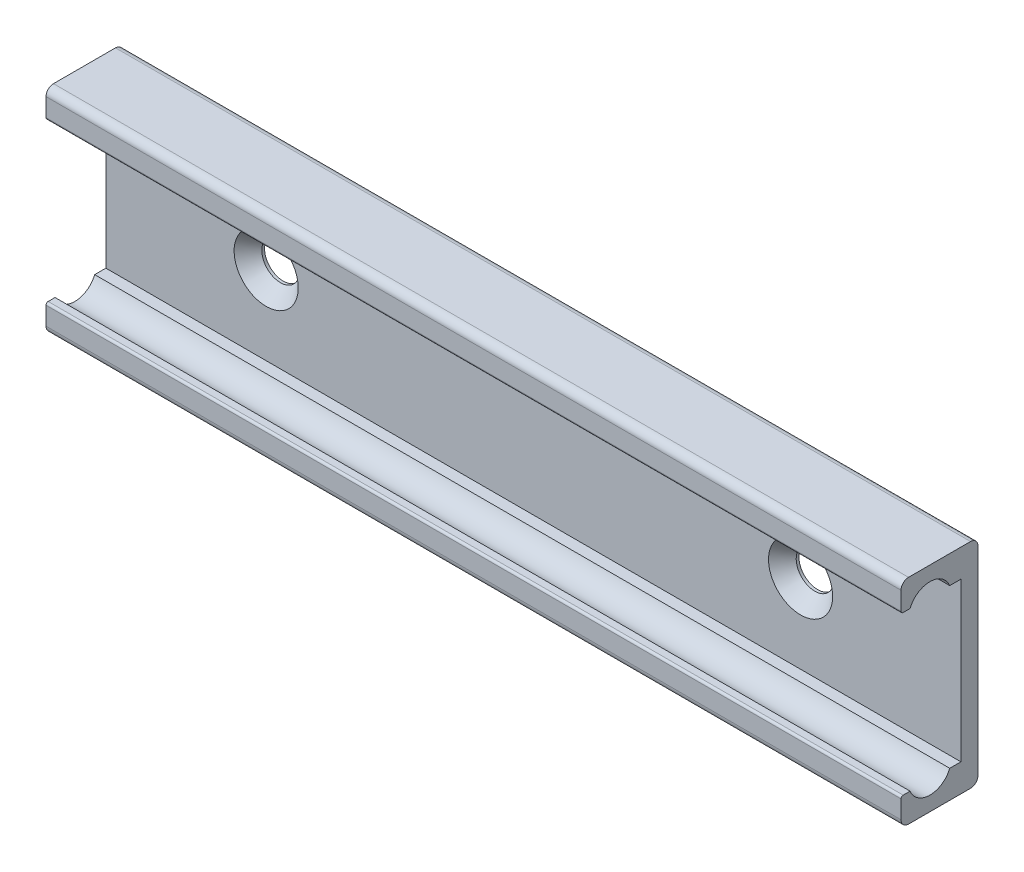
ISO-10303-21;
HEADER;
FILE_DESCRIPTION(('STEP AP214'),'2;1');
FILE_NAME('part.step','',(''),(''),'','','');
FILE_SCHEMA(('AUTOMOTIVE_DESIGN { 1 0 10303 214 1 1 1 1 }'));
ENDSEC;
DATA;
#1=APPLICATION_CONTEXT('core data for automotive mechanical design processes');
#2=APPLICATION_PROTOCOL_DEFINITION('international standard','automotive_design',2000,#1);
#3=PRODUCT_CONTEXT('',#1,'mechanical');
#4=PRODUCT('Part','Part','',(#3));
#5=PRODUCT_RELATED_PRODUCT_CATEGORY('part','',(#4));
#6=PRODUCT_DEFINITION_FORMATION('','',#4);
#7=PRODUCT_DEFINITION_CONTEXT('part definition',#1,'design');
#8=PRODUCT_DEFINITION('design','',#6,#7);
#9=PRODUCT_DEFINITION_SHAPE('','',#8);
#10=(LENGTH_UNIT() NAMED_UNIT(*) SI_UNIT(.MILLI.,.METRE.));
#11=(NAMED_UNIT(*) PLANE_ANGLE_UNIT() SI_UNIT($,.RADIAN.));
#12=(NAMED_UNIT(*) SI_UNIT($,.STERADIAN.) SOLID_ANGLE_UNIT());
#13=UNCERTAINTY_MEASURE_WITH_UNIT(LENGTH_MEASURE(1.E-05),#10,'distance_accuracy_value','');
#14=(GEOMETRIC_REPRESENTATION_CONTEXT(3) GLOBAL_UNCERTAINTY_ASSIGNED_CONTEXT((#13)) GLOBAL_UNIT_ASSIGNED_CONTEXT((#10,
#11,#12)) REPRESENTATION_CONTEXT('',''));
#15=CARTESIAN_POINT('',(0.,0.,0.));
#16=DIRECTION('',(0.,0.,1.));
#17=DIRECTION('',(1.,0.,0.));
#18=AXIS2_PLACEMENT_3D('',#15,#16,#17);
#19=CARTESIAN_POINT('',(65.,9.3,6.49999999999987));
#20=DIRECTION('',(-1.,0.,0.));
#21=DIRECTION('',(0.,0.,1.));
#22=AXIS2_PLACEMENT_3D('',#19,#20,#21);
#23=CYLINDRICAL_SURFACE('',#22,0.7);
#24=CARTESIAN_POINT('',(-15.,9.3,6.49999999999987));
#25=DIRECTION('',(-1.,0.,0.));
#26=DIRECTION('',(0.,0.,-1.));
#27=AXIS2_PLACEMENT_3D('',#24,#25,#26);
#28=CIRCLE('',#27,0.7);
#29=CARTESIAN_POINT('',(-15.,9.3,7.19999999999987));
#30=VERTEX_POINT('',#29);
#31=CARTESIAN_POINT('',(-15.,10.,6.49999999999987));
#32=VERTEX_POINT('',#31);
#33=EDGE_CURVE('E139',#30,#32,#28,.T.);
#34=ORIENTED_EDGE('',*,*,#33,.F.);
#35=DIRECTION('',(-1.,0.,0.));
#36=VECTOR('',#35,1.);
#37=CARTESIAN_POINT('',(65.,9.3,7.19999999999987));
#38=LINE('',#37,#36);
#39=CARTESIAN_POINT('',(65.,9.3,7.19999999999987));
#40=VERTEX_POINT('',#39);
#41=EDGE_CURVE('E9',#40,#30,#38,.T.);
#42=ORIENTED_EDGE('',*,*,#41,.F.);
#43=CARTESIAN_POINT('',(65.,9.3,6.49999999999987));
#44=DIRECTION('',(-1.,0.,0.));
#45=DIRECTION('',(0.,0.,-1.));
#46=AXIS2_PLACEMENT_3D('',#43,#44,#45);
#47=CIRCLE('',#46,0.7);
#48=CARTESIAN_POINT('',(65.,10.,6.49999999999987));
#49=VERTEX_POINT('',#48);
#50=EDGE_CURVE('E141',#40,#49,#47,.T.);
#51=ORIENTED_EDGE('',*,*,#50,.T.);
#52=DIRECTION('',(-1.,0.,0.));
#53=VECTOR('',#52,1.);
#54=CARTESIAN_POINT('',(65.,10.,6.49999999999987));
#55=LINE('',#54,#53);
#56=EDGE_CURVE('E136',#49,#32,#55,.T.);
#57=ORIENTED_EDGE('',*,*,#56,.T.);
#58=EDGE_LOOP('',(#34,#42,#51,#57));
#59=FACE_BOUND('',#58,.T.);
#60=ADVANCED_FACE('F14',(#59),#23,.T.);
#61=CARTESIAN_POINT('',(65.,7.60000008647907,7.19999999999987));
#62=DIRECTION('',(0.,0.,1.));
#63=DIRECTION('',(1.,0.,0.));
#64=AXIS2_PLACEMENT_3D('',#61,#62,#63);
#65=PLANE('',#64);
#66=DIRECTION('',(0.,1.,0.));
#67=VECTOR('',#66,1.);
#68=CARTESIAN_POINT('',(-15.,7.60000008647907,7.19999999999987));
#69=LINE('',#68,#67);
#70=CARTESIAN_POINT('',(-15.,7.60000008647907,7.19999999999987));
#71=VERTEX_POINT('',#70);
#72=EDGE_CURVE('E158',#71,#30,#69,.T.);
#73=ORIENTED_EDGE('',*,*,#72,.F.);
#74=DIRECTION('',(-1.,0.,0.));
#75=VECTOR('',#74,1.);
#76=CARTESIAN_POINT('',(65.,7.60000008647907,7.19999999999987));
#77=LINE('',#76,#75);
#78=CARTESIAN_POINT('',(65.,7.60000008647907,7.19999999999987));
#79=VERTEX_POINT('',#78);
#80=EDGE_CURVE('E22',#79,#71,#77,.T.);
#81=ORIENTED_EDGE('',*,*,#80,.F.);
#82=DIRECTION('',(0.,1.,0.));
#83=VECTOR('',#82,1.);
#84=CARTESIAN_POINT('',(65.,7.60000008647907,7.19999999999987));
#85=LINE('',#84,#83);
#86=EDGE_CURVE('E146',#79,#40,#85,.T.);
#87=ORIENTED_EDGE('',*,*,#86,.T.);
#88=ORIENTED_EDGE('',*,*,#41,.T.);
#89=EDGE_LOOP('',(#73,#81,#87,#88));
#90=FACE_BOUND('',#89,.T.);
#91=ADVANCED_FACE('F319',(#90),#65,.T.);
#92=CARTESIAN_POINT('',(65.,7.60000008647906,6.99999999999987));
#93=DIRECTION('',(-1.,0.,0.));
#94=DIRECTION('',(0.,0.,1.));
#95=AXIS2_PLACEMENT_3D('',#92,#93,#94);
#96=CYLINDRICAL_SURFACE('',#95,0.2);
#97=CARTESIAN_POINT('',(-15.,7.60000008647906,6.99999999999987));
#98=DIRECTION('',(-1.,0.,0.));
#99=DIRECTION('',(0.,0.,-1.));
#100=AXIS2_PLACEMENT_3D('',#97,#98,#99);
#101=CIRCLE('',#100,0.2);
#102=CARTESIAN_POINT('',(-15.,7.40000008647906,6.99999999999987));
#103=VERTEX_POINT('',#102);
#104=EDGE_CURVE('E206',#103,#71,#101,.T.);
#105=ORIENTED_EDGE('',*,*,#104,.F.);
#106=DIRECTION('',(-1.,0.,0.));
#107=VECTOR('',#106,1.);
#108=CARTESIAN_POINT('',(65.,7.40000008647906,6.99999999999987));
#109=LINE('',#108,#107);
#110=CARTESIAN_POINT('',(65.,7.40000008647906,6.99999999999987));
#111=VERTEX_POINT('',#110);
#112=EDGE_CURVE('E258',#111,#103,#109,.T.);
#113=ORIENTED_EDGE('',*,*,#112,.F.);
#114=CARTESIAN_POINT('',(65.,7.60000008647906,6.99999999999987));
#115=DIRECTION('',(-1.,0.,0.));
#116=DIRECTION('',(0.,0.,-1.));
#117=AXIS2_PLACEMENT_3D('',#114,#115,#116);
#118=CIRCLE('',#117,0.2);
#119=EDGE_CURVE('E254',#111,#79,#118,.T.);
#120=ORIENTED_EDGE('',*,*,#119,.T.);
#121=ORIENTED_EDGE('',*,*,#80,.T.);
#122=EDGE_LOOP('',(#105,#113,#120,#121));
#123=FACE_BOUND('',#122,.T.);
#124=ADVANCED_FACE('F324',(#123),#96,.T.);
#125=CARTESIAN_POINT('',(65.,7.40000008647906,6.35404949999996));
#126=DIRECTION('',(0.,-1.,0.));
#127=DIRECTION('',(1.,0.,0.));
#128=AXIS2_PLACEMENT_3D('',#125,#126,#127);
#129=PLANE('',#128);
#130=DIRECTION('',(0.,0.,1.));
#131=VECTOR('',#130,1.);
#132=CARTESIAN_POINT('',(-15.,7.40000008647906,6.35404949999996));
#133=LINE('',#132,#131);
#134=CARTESIAN_POINT('',(-15.,7.40000008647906,6.35404949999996));
#135=VERTEX_POINT('',#134);
#136=EDGE_CURVE('E203',#135,#103,#133,.T.);
#137=ORIENTED_EDGE('',*,*,#136,.F.);
#138=DIRECTION('',(-1.,0.,0.));
#139=VECTOR('',#138,1.);
#140=CARTESIAN_POINT('',(65.,7.40000008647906,6.35404949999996));
#141=LINE('',#140,#139);
#142=CARTESIAN_POINT('',(65.,7.40000008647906,6.35404949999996));
#143=VERTEX_POINT('',#142);
#144=EDGE_CURVE('E260',#143,#135,#141,.T.);
#145=ORIENTED_EDGE('',*,*,#144,.F.);
#146=DIRECTION('',(0.,0.,1.));
#147=VECTOR('',#146,1.);
#148=CARTESIAN_POINT('',(65.,7.40000008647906,6.35404949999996));
#149=LINE('',#148,#147);
#150=EDGE_CURVE('E251',#143,#111,#149,.T.);
#151=ORIENTED_EDGE('',*,*,#150,.T.);
#152=ORIENTED_EDGE('',*,*,#112,.T.);
#153=EDGE_LOOP('',(#137,#145,#151,#152));
#154=FACE_BOUND('',#153,.T.);
#155=ADVANCED_FACE('F330',(#154),#129,.T.);
#156=CARTESIAN_POINT('',(65.,6.65000008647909,4.50000000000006));
#157=DIRECTION('',(-1.,0.,0.));
#158=DIRECTION('',(0.,0.,1.));
#159=AXIS2_PLACEMENT_3D('',#156,#157,#158);
#160=CYLINDRICAL_SURFACE('',#159,1.99999988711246);
#161=CARTESIAN_POINT('',(-15.,6.65000008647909,4.50000000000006));
#162=DIRECTION('',(1.,0.,0.));
#163=DIRECTION('',(0.,0.,1.));
#164=AXIS2_PLACEMENT_3D('',#161,#162,#163);
#165=CIRCLE('',#164,1.99999988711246);
#166=CARTESIAN_POINT('',(-15.,7.40000008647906,2.64595050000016));
#167=VERTEX_POINT('',#166);
#168=EDGE_CURVE('E200',#167,#135,#165,.T.);
#169=ORIENTED_EDGE('',*,*,#168,.F.);
#170=DIRECTION('',(-1.,0.,0.));
#171=VECTOR('',#170,1.);
#172=CARTESIAN_POINT('',(65.,7.40000008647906,2.64595050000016));
#173=LINE('',#172,#171);
#174=CARTESIAN_POINT('',(65.,7.40000008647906,2.64595050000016));
#175=VERTEX_POINT('',#174);
#176=EDGE_CURVE('E262',#175,#167,#173,.T.);
#177=ORIENTED_EDGE('',*,*,#176,.F.);
#178=CARTESIAN_POINT('',(65.,6.65000008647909,4.50000000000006));
#179=DIRECTION('',(1.,0.,0.));
#180=DIRECTION('',(0.,0.,1.));
#181=AXIS2_PLACEMENT_3D('',#178,#179,#180);
#182=CIRCLE('',#181,1.99999988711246);
#183=EDGE_CURVE('E248',#175,#143,#182,.T.);
#184=ORIENTED_EDGE('',*,*,#183,.T.);
#185=ORIENTED_EDGE('',*,*,#144,.T.);
#186=EDGE_LOOP('',(#169,#177,#184,#185));
#187=FACE_BOUND('',#186,.T.);
#188=ADVANCED_FACE('F339',(#187),#160,.F.);
#189=CARTESIAN_POINT('',(65.,7.40000008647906,1.60000000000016));
#190=DIRECTION('',(0.,-1.,0.));
#191=DIRECTION('',(1.,0.,0.));
#192=AXIS2_PLACEMENT_3D('',#189,#190,#191);
#193=PLANE('',#192);
#194=DIRECTION('',(0.,0.,1.));
#195=VECTOR('',#194,1.);
#196=CARTESIAN_POINT('',(-15.,7.40000008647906,1.60000000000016));
#197=LINE('',#196,#195);
#198=CARTESIAN_POINT('',(-15.,7.40000008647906,1.60000000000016));
#199=VERTEX_POINT('',#198);
#200=EDGE_CURVE('E197',#199,#167,#197,.T.);
#201=ORIENTED_EDGE('',*,*,#200,.F.);
#202=DIRECTION('',(-1.,0.,0.));
#203=VECTOR('',#202,1.);
#204=CARTESIAN_POINT('',(65.,7.40000008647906,1.60000000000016));
#205=LINE('',#204,#203);
#206=CARTESIAN_POINT('',(65.,7.40000008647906,1.60000000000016));
#207=VERTEX_POINT('',#206);
#208=EDGE_CURVE('E264',#207,#199,#205,.T.);
#209=ORIENTED_EDGE('',*,*,#208,.F.);
#210=DIRECTION('',(0.,0.,1.));
#211=VECTOR('',#210,1.);
#212=CARTESIAN_POINT('',(65.,7.40000008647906,1.60000000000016));
#213=LINE('',#212,#211);
#214=EDGE_CURVE('E245',#207,#175,#213,.T.);
#215=ORIENTED_EDGE('',*,*,#214,.T.);
#216=ORIENTED_EDGE('',*,*,#176,.T.);
#217=EDGE_LOOP('',(#201,#209,#215,#216));
#218=FACE_BOUND('',#217,.T.);
#219=ADVANCED_FACE('F343',(#218),#193,.T.);
#220=CARTESIAN_POINT('',(65.,-7.40000008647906,1.60000000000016));
#221=DIRECTION('',(0.,0.,1.));
#222=DIRECTION('',(0.,1.,0.));
#223=AXIS2_PLACEMENT_3D('',#220,#221,#222);
#224=PLANE('',#223);
#225=CARTESIAN_POINT('',(50.,0.,1.60000000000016));
#226=DIRECTION('',(0.,0.,1.));
#227=DIRECTION('',(0.,1.,0.));
#228=AXIS2_PLACEMENT_3D('',#225,#226,#227);
#229=CIRCLE('',#228,3.);
#230=CARTESIAN_POINT('',(50.,3.,1.60000000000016));
#231=VERTEX_POINT('',#230);
#232=EDGE_CURVE('E291',#231,#231,#229,.T.);
#233=ORIENTED_EDGE('',*,*,#232,.F.);
#234=EDGE_LOOP('',(#233));
#235=FACE_BOUND('',#234,.T.);
#236=CARTESIAN_POINT('',(0.,0.,1.60000000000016));
#237=DIRECTION('',(0.,0.,1.));
#238=DIRECTION('',(0.,1.,0.));
#239=AXIS2_PLACEMENT_3D('',#236,#237,#238);
#240=CIRCLE('',#239,3.);
#241=CARTESIAN_POINT('',(0.,3.,1.60000000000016));
#242=VERTEX_POINT('',#241);
#243=EDGE_CURVE('E159',#242,#242,#240,.T.);
#244=ORIENTED_EDGE('',*,*,#243,.F.);
#245=EDGE_LOOP('',(#244));
#246=FACE_BOUND('',#245,.T.);
#247=DIRECTION('',(0.,1.,0.));
#248=VECTOR('',#247,1.);
#249=CARTESIAN_POINT('',(-15.,-7.40000008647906,1.60000000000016));
#250=LINE('',#249,#248);
#251=CARTESIAN_POINT('',(-15.,-7.40000008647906,1.60000000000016));
#252=VERTEX_POINT('',#251);
#253=EDGE_CURVE('E194',#252,#199,#250,.T.);
#254=ORIENTED_EDGE('',*,*,#253,.F.);
#255=DIRECTION('',(-1.,0.,0.));
#256=VECTOR('',#255,1.);
#257=CARTESIAN_POINT('',(65.,-7.40000008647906,1.60000000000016));
#258=LINE('',#257,#256);
#259=CARTESIAN_POINT('',(65.,-7.40000008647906,1.60000000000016));
#260=VERTEX_POINT('',#259);
#261=EDGE_CURVE('E266',#260,#252,#258,.T.);
#262=ORIENTED_EDGE('',*,*,#261,.F.);
#263=DIRECTION('',(0.,1.,0.));
#264=VECTOR('',#263,1.);
#265=CARTESIAN_POINT('',(65.,-7.40000008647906,1.60000000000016));
#266=LINE('',#265,#264);
#267=EDGE_CURVE('E242',#260,#207,#266,.T.);
#268=ORIENTED_EDGE('',*,*,#267,.T.);
#269=ORIENTED_EDGE('',*,*,#208,.T.);
#270=EDGE_LOOP('',(#254,#262,#268,#269));
#271=FACE_BOUND('',#270,.T.);
#272=ADVANCED_FACE('F347',(#235,#246,#271),#224,.T.);
#273=CARTESIAN_POINT('',(65.,-7.40000008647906,1.60000000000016));
#274=DIRECTION('',(0.,1.,0.));
#275=DIRECTION('',(-1.,0.,0.));
#276=AXIS2_PLACEMENT_3D('',#273,#274,#275);
#277=PLANE('',#276);
#278=DIRECTION('',(0.,0.,-1.));
#279=VECTOR('',#278,1.);
#280=CARTESIAN_POINT('',(-15.,-7.40000008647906,1.60000000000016));
#281=LINE('',#280,#279);
#282=CARTESIAN_POINT('',(-15.,-7.40000008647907,2.64595050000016));
#283=VERTEX_POINT('',#282);
#284=EDGE_CURVE('E191',#283,#252,#281,.T.);
#285=ORIENTED_EDGE('',*,*,#284,.F.);
#286=DIRECTION('',(-1.,0.,0.));
#287=VECTOR('',#286,1.);
#288=CARTESIAN_POINT('',(65.,-7.40000008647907,2.64595050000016));
#289=LINE('',#288,#287);
#290=CARTESIAN_POINT('',(65.,-7.40000008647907,2.64595050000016));
#291=VERTEX_POINT('',#290);
#292=EDGE_CURVE('E268',#291,#283,#289,.T.);
#293=ORIENTED_EDGE('',*,*,#292,.F.);
#294=DIRECTION('',(0.,0.,-1.));
#295=VECTOR('',#294,1.);
#296=CARTESIAN_POINT('',(65.,-7.40000008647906,1.60000000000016));
#297=LINE('',#296,#295);
#298=EDGE_CURVE('E239',#291,#260,#297,.T.);
#299=ORIENTED_EDGE('',*,*,#298,.T.);
#300=ORIENTED_EDGE('',*,*,#261,.T.);
#301=EDGE_LOOP('',(#285,#293,#299,#300));
#302=FACE_BOUND('',#301,.T.);
#303=ADVANCED_FACE('F351',(#302),#277,.T.);
#304=CARTESIAN_POINT('',(65.,-6.65000008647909,4.50000000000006));
#305=DIRECTION('',(-1.,0.,0.));
#306=DIRECTION('',(0.,0.,1.));
#307=AXIS2_PLACEMENT_3D('',#304,#305,#306);
#308=CYLINDRICAL_SURFACE('',#307,1.99999988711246);
#309=CARTESIAN_POINT('',(-15.,-6.65000008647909,4.50000000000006));
#310=DIRECTION('',(1.,0.,0.));
#311=DIRECTION('',(0.,0.,-1.));
#312=AXIS2_PLACEMENT_3D('',#309,#310,#311);
#313=CIRCLE('',#312,1.99999988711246);
#314=CARTESIAN_POINT('',(-15.,-7.40000008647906,6.35404949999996));
#315=VERTEX_POINT('',#314);
#316=EDGE_CURVE('E188',#315,#283,#313,.T.);
#317=ORIENTED_EDGE('',*,*,#316,.F.);
#318=DIRECTION('',(-1.,0.,0.));
#319=VECTOR('',#318,1.);
#320=CARTESIAN_POINT('',(65.,-7.40000008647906,6.35404949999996));
#321=LINE('',#320,#319);
#322=CARTESIAN_POINT('',(65.,-7.40000008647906,6.35404949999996));
#323=VERTEX_POINT('',#322);
#324=EDGE_CURVE('E270',#323,#315,#321,.T.);
#325=ORIENTED_EDGE('',*,*,#324,.F.);
#326=CARTESIAN_POINT('',(65.,-6.65000008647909,4.50000000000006));
#327=DIRECTION('',(1.,0.,0.));
#328=DIRECTION('',(0.,0.,-1.));
#329=AXIS2_PLACEMENT_3D('',#326,#327,#328);
#330=CIRCLE('',#329,1.99999988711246);
#331=EDGE_CURVE('E236',#323,#291,#330,.T.);
#332=ORIENTED_EDGE('',*,*,#331,.T.);
#333=ORIENTED_EDGE('',*,*,#292,.T.);
#334=EDGE_LOOP('',(#317,#325,#332,#333));
#335=FACE_BOUND('',#334,.T.);
#336=ADVANCED_FACE('F355',(#335),#308,.F.);
#337=CARTESIAN_POINT('',(65.,-7.40000008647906,6.35404949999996));
#338=DIRECTION('',(0.,1.,0.));
#339=DIRECTION('',(-1.,0.,0.));
#340=AXIS2_PLACEMENT_3D('',#337,#338,#339);
#341=PLANE('',#340);
#342=DIRECTION('',(0.,0.,-1.));
#343=VECTOR('',#342,1.);
#344=CARTESIAN_POINT('',(-15.,-7.40000008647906,6.35404949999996));
#345=LINE('',#344,#343);
#346=CARTESIAN_POINT('',(-15.,-7.40000008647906,6.99999999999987));
#347=VERTEX_POINT('',#346);
#348=EDGE_CURVE('E185',#347,#315,#345,.T.);
#349=ORIENTED_EDGE('',*,*,#348,.F.);
#350=DIRECTION('',(-1.,0.,0.));
#351=VECTOR('',#350,1.);
#352=CARTESIAN_POINT('',(65.,-7.40000008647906,6.99999999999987));
#353=LINE('',#352,#351);
#354=CARTESIAN_POINT('',(65.,-7.40000008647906,6.99999999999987));
#355=VERTEX_POINT('',#354);
#356=EDGE_CURVE('E272',#355,#347,#353,.T.);
#357=ORIENTED_EDGE('',*,*,#356,.F.);
#358=DIRECTION('',(0.,0.,-1.));
#359=VECTOR('',#358,1.);
#360=CARTESIAN_POINT('',(65.,-7.40000008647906,6.35404949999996));
#361=LINE('',#360,#359);
#362=EDGE_CURVE('E233',#355,#323,#361,.T.);
#363=ORIENTED_EDGE('',*,*,#362,.T.);
#364=ORIENTED_EDGE('',*,*,#324,.T.);
#365=EDGE_LOOP('',(#349,#357,#363,#364));
#366=FACE_BOUND('',#365,.T.);
#367=ADVANCED_FACE('F359',(#366),#341,.T.);
#368=CARTESIAN_POINT('',(65.,-7.60000008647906,6.99999999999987));
#369=DIRECTION('',(-1.,0.,0.));
#370=DIRECTION('',(0.,0.,1.));
#371=AXIS2_PLACEMENT_3D('',#368,#369,#370);
#372=CYLINDRICAL_SURFACE('',#371,0.2);
#373=CARTESIAN_POINT('',(-15.,-7.60000008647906,6.99999999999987));
#374=DIRECTION('',(-1.,0.,0.));
#375=DIRECTION('',(0.,0.,1.));
#376=AXIS2_PLACEMENT_3D('',#373,#374,#375);
#377=CIRCLE('',#376,0.2);
#378=CARTESIAN_POINT('',(-15.,-7.60000008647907,7.19999999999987));
#379=VERTEX_POINT('',#378);
#380=EDGE_CURVE('E182',#379,#347,#377,.T.);
#381=ORIENTED_EDGE('',*,*,#380,.F.);
#382=DIRECTION('',(-1.,0.,0.));
#383=VECTOR('',#382,1.);
#384=CARTESIAN_POINT('',(65.,-7.60000008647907,7.19999999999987));
#385=LINE('',#384,#383);
#386=CARTESIAN_POINT('',(65.,-7.60000008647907,7.19999999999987));
#387=VERTEX_POINT('',#386);
#388=EDGE_CURVE('E274',#387,#379,#385,.T.);
#389=ORIENTED_EDGE('',*,*,#388,.F.);
#390=CARTESIAN_POINT('',(65.,-7.60000008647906,6.99999999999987));
#391=DIRECTION('',(-1.,0.,0.));
#392=DIRECTION('',(0.,0.,1.));
#393=AXIS2_PLACEMENT_3D('',#390,#391,#392);
#394=CIRCLE('',#393,0.2);
#395=EDGE_CURVE('E230',#387,#355,#394,.T.);
#396=ORIENTED_EDGE('',*,*,#395,.T.);
#397=ORIENTED_EDGE('',*,*,#356,.T.);
#398=EDGE_LOOP('',(#381,#389,#396,#397));
#399=FACE_BOUND('',#398,.T.);
#400=ADVANCED_FACE('F363',(#399),#372,.T.);
#401=CARTESIAN_POINT('',(65.,-7.60000008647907,7.19999999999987));
#402=DIRECTION('',(0.,0.,1.));
#403=DIRECTION('',(1.,0.,0.));
#404=AXIS2_PLACEMENT_3D('',#401,#402,#403);
#405=PLANE('',#404);
#406=DIRECTION('',(0.,1.,0.));
#407=VECTOR('',#406,1.);
#408=CARTESIAN_POINT('',(-15.,-7.60000008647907,7.19999999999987));
#409=LINE('',#408,#407);
#410=CARTESIAN_POINT('',(-15.,-9.3,7.19999999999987));
#411=VERTEX_POINT('',#410);
#412=EDGE_CURVE('E179',#411,#379,#409,.T.);
#413=ORIENTED_EDGE('',*,*,#412,.F.);
#414=DIRECTION('',(-1.,0.,0.));
#415=VECTOR('',#414,1.);
#416=CARTESIAN_POINT('',(65.,-9.3,7.19999999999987));
#417=LINE('',#416,#415);
#418=CARTESIAN_POINT('',(65.,-9.3,7.19999999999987));
#419=VERTEX_POINT('',#418);
#420=EDGE_CURVE('E276',#419,#411,#417,.T.);
#421=ORIENTED_EDGE('',*,*,#420,.F.);
#422=DIRECTION('',(0.,1.,0.));
#423=VECTOR('',#422,1.);
#424=CARTESIAN_POINT('',(65.,-7.60000008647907,7.19999999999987));
#425=LINE('',#424,#423);
#426=EDGE_CURVE('E227',#419,#387,#425,.T.);
#427=ORIENTED_EDGE('',*,*,#426,.T.);
#428=ORIENTED_EDGE('',*,*,#388,.T.);
#429=EDGE_LOOP('',(#413,#421,#427,#428));
#430=FACE_BOUND('',#429,.T.);
#431=ADVANCED_FACE('F367',(#430),#405,.T.);
#432=CARTESIAN_POINT('',(65.,-9.3,6.49999999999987));
#433=DIRECTION('',(-1.,0.,0.));
#434=DIRECTION('',(0.,0.,1.));
#435=AXIS2_PLACEMENT_3D('',#432,#433,#434);
#436=CYLINDRICAL_SURFACE('',#435,0.7);
#437=CARTESIAN_POINT('',(-15.,-9.3,6.49999999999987));
#438=DIRECTION('',(-1.,0.,0.));
#439=DIRECTION('',(0.,0.,1.));
#440=AXIS2_PLACEMENT_3D('',#437,#438,#439);
#441=CIRCLE('',#440,0.7);
#442=CARTESIAN_POINT('',(-15.,-10.,6.49999999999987));
#443=VERTEX_POINT('',#442);
#444=EDGE_CURVE('E176',#443,#411,#441,.T.);
#445=ORIENTED_EDGE('',*,*,#444,.F.);
#446=DIRECTION('',(-1.,0.,0.));
#447=VECTOR('',#446,1.);
#448=CARTESIAN_POINT('',(65.,-10.,6.49999999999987));
#449=LINE('',#448,#447);
#450=CARTESIAN_POINT('',(65.,-10.,6.49999999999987));
#451=VERTEX_POINT('',#450);
#452=EDGE_CURVE('E278',#451,#443,#449,.T.);
#453=ORIENTED_EDGE('',*,*,#452,.F.);
#454=CARTESIAN_POINT('',(65.,-9.3,6.49999999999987));
#455=DIRECTION('',(-1.,0.,0.));
#456=DIRECTION('',(0.,0.,1.));
#457=AXIS2_PLACEMENT_3D('',#454,#455,#456);
#458=CIRCLE('',#457,0.7);
#459=EDGE_CURVE('E224',#451,#419,#458,.T.);
#460=ORIENTED_EDGE('',*,*,#459,.T.);
#461=ORIENTED_EDGE('',*,*,#420,.T.);
#462=EDGE_LOOP('',(#445,#453,#460,#461));
#463=FACE_BOUND('',#462,.T.);
#464=ADVANCED_FACE('F371',(#463),#436,.T.);
#465=CARTESIAN_POINT('',(65.,-10.,0.7));
#466=DIRECTION('',(0.,-1.,0.));
#467=DIRECTION('',(1.,0.,0.));
#468=AXIS2_PLACEMENT_3D('',#465,#466,#467);
#469=PLANE('',#468);
#470=DIRECTION('',(0.,0.,1.));
#471=VECTOR('',#470,1.);
#472=CARTESIAN_POINT('',(-15.,-10.,0.7));
#473=LINE('',#472,#471);
#474=CARTESIAN_POINT('',(-15.,-10.,0.7));
#475=VERTEX_POINT('',#474);
#476=EDGE_CURVE('E173',#475,#443,#473,.T.);
#477=ORIENTED_EDGE('',*,*,#476,.F.);
#478=DIRECTION('',(-1.,0.,0.));
#479=VECTOR('',#478,1.);
#480=CARTESIAN_POINT('',(65.,-10.,0.7));
#481=LINE('',#480,#479);
#482=CARTESIAN_POINT('',(65.,-10.,0.7));
#483=VERTEX_POINT('',#482);
#484=EDGE_CURVE('E280',#483,#475,#481,.T.);
#485=ORIENTED_EDGE('',*,*,#484,.F.);
#486=DIRECTION('',(0.,0.,1.));
#487=VECTOR('',#486,1.);
#488=CARTESIAN_POINT('',(65.,-10.,0.7));
#489=LINE('',#488,#487);
#490=EDGE_CURVE('E221',#483,#451,#489,.T.);
#491=ORIENTED_EDGE('',*,*,#490,.T.);
#492=ORIENTED_EDGE('',*,*,#452,.T.);
#493=EDGE_LOOP('',(#477,#485,#491,#492));
#494=FACE_BOUND('',#493,.T.);
#495=ADVANCED_FACE('F375',(#494),#469,.T.);
#496=CARTESIAN_POINT('',(65.,-9.3,0.7));
#497=DIRECTION('',(-1.,0.,0.));
#498=DIRECTION('',(0.,0.,1.));
#499=AXIS2_PLACEMENT_3D('',#496,#497,#498);
#500=CYLINDRICAL_SURFACE('',#499,0.7);
#501=CARTESIAN_POINT('',(-15.,-9.3,0.7));
#502=DIRECTION('',(-1.,0.,0.));
#503=DIRECTION('',(0.,0.,1.));
#504=AXIS2_PLACEMENT_3D('',#501,#502,#503);
#505=CIRCLE('',#504,0.7);
#506=CARTESIAN_POINT('',(-15.,-9.3,0.));
#507=VERTEX_POINT('',#506);
#508=EDGE_CURVE('E170',#507,#475,#505,.T.);
#509=ORIENTED_EDGE('',*,*,#508,.F.);
#510=DIRECTION('',(-1.,0.,0.));
#511=VECTOR('',#510,1.);
#512=CARTESIAN_POINT('',(65.,-9.3,0.));
#513=LINE('',#512,#511);
#514=CARTESIAN_POINT('',(65.,-9.3,0.));
#515=VERTEX_POINT('',#514);
#516=EDGE_CURVE('E282',#515,#507,#513,.T.);
#517=ORIENTED_EDGE('',*,*,#516,.F.);
#518=CARTESIAN_POINT('',(65.,-9.3,0.7));
#519=DIRECTION('',(-1.,0.,0.));
#520=DIRECTION('',(0.,0.,1.));
#521=AXIS2_PLACEMENT_3D('',#518,#519,#520);
#522=CIRCLE('',#521,0.7);
#523=EDGE_CURVE('E218',#515,#483,#522,.T.);
#524=ORIENTED_EDGE('',*,*,#523,.T.);
#525=ORIENTED_EDGE('',*,*,#484,.T.);
#526=EDGE_LOOP('',(#509,#517,#524,#525));
#527=FACE_BOUND('',#526,.T.);
#528=ADVANCED_FACE('F379',(#527),#500,.T.);
#529=CARTESIAN_POINT('',(65.,-9.3,0.));
#530=DIRECTION('',(0.,0.,-1.));
#531=DIRECTION('',(-1.,0.,0.));
#532=AXIS2_PLACEMENT_3D('',#529,#530,#531);
#533=PLANE('',#532);
#534=CARTESIAN_POINT('',(50.,0.,0.));
#535=DIRECTION('',(0.,0.,1.));
#536=DIRECTION('',(0.,1.,0.));
#537=AXIS2_PLACEMENT_3D('',#534,#535,#536);
#538=CIRCLE('',#537,1.75);
#539=CARTESIAN_POINT('',(50.,1.75,0.));
#540=VERTEX_POINT('',#539);
#541=EDGE_CURVE('E297',#540,#540,#538,.T.);
#542=ORIENTED_EDGE('',*,*,#541,.T.);
#543=EDGE_LOOP('',(#542));
#544=FACE_BOUND('',#543,.T.);
#545=CARTESIAN_POINT('',(0.,0.,0.));
#546=DIRECTION('',(0.,0.,1.));
#547=DIRECTION('',(0.,1.,0.));
#548=AXIS2_PLACEMENT_3D('',#545,#546,#547);
#549=CIRCLE('',#548,1.75);
#550=CARTESIAN_POINT('',(0.,1.75,0.));
#551=VERTEX_POINT('',#550);
#552=EDGE_CURVE('E287',#551,#551,#549,.T.);
#553=ORIENTED_EDGE('',*,*,#552,.T.);
#554=EDGE_LOOP('',(#553));
#555=FACE_BOUND('',#554,.T.);
#556=DIRECTION('',(0.,-1.,0.));
#557=VECTOR('',#556,1.);
#558=CARTESIAN_POINT('',(-15.,-9.3,0.));
#559=LINE('',#558,#557);
#560=CARTESIAN_POINT('',(-15.,9.3,0.));
#561=VERTEX_POINT('',#560);
#562=EDGE_CURVE('E167',#561,#507,#559,.T.);
#563=ORIENTED_EDGE('',*,*,#562,.F.);
#564=DIRECTION('',(-1.,0.,0.));
#565=VECTOR('',#564,1.);
#566=CARTESIAN_POINT('',(65.,9.3,0.));
#567=LINE('',#566,#565);
#568=CARTESIAN_POINT('',(65.,9.3,0.));
#569=VERTEX_POINT('',#568);
#570=EDGE_CURVE('E284',#569,#561,#567,.T.);
#571=ORIENTED_EDGE('',*,*,#570,.F.);
#572=DIRECTION('',(0.,-1.,0.));
#573=VECTOR('',#572,1.);
#574=CARTESIAN_POINT('',(65.,-9.3,0.));
#575=LINE('',#574,#573);
#576=EDGE_CURVE('E215',#569,#515,#575,.T.);
#577=ORIENTED_EDGE('',*,*,#576,.T.);
#578=ORIENTED_EDGE('',*,*,#516,.T.);
#579=EDGE_LOOP('',(#563,#571,#577,#578));
#580=FACE_BOUND('',#579,.T.);
#581=ADVANCED_FACE('F383',(#544,#555,#580),#533,.T.);
#582=CARTESIAN_POINT('',(65.,9.3,0.7));
#583=DIRECTION('',(-1.,0.,0.));
#584=DIRECTION('',(0.,0.,1.));
#585=AXIS2_PLACEMENT_3D('',#582,#583,#584);
#586=CYLINDRICAL_SURFACE('',#585,0.7);
#587=CARTESIAN_POINT('',(-15.,9.3,0.7));
#588=DIRECTION('',(-1.,0.,0.));
#589=DIRECTION('',(0.,0.,-1.));
#590=AXIS2_PLACEMENT_3D('',#587,#588,#589);
#591=CIRCLE('',#590,0.7);
#592=CARTESIAN_POINT('',(-15.,10.,0.7));
#593=VERTEX_POINT('',#592);
#594=EDGE_CURVE('E154',#593,#561,#591,.T.);
#595=ORIENTED_EDGE('',*,*,#594,.F.);
#596=DIRECTION('',(-1.,0.,0.));
#597=VECTOR('',#596,1.);
#598=CARTESIAN_POINT('',(65.,10.,0.7));
#599=LINE('',#598,#597);
#600=CARTESIAN_POINT('',(65.,10.,0.7));
#601=VERTEX_POINT('',#600);
#602=EDGE_CURVE('E145',#601,#593,#599,.T.);
#603=ORIENTED_EDGE('',*,*,#602,.F.);
#604=CARTESIAN_POINT('',(65.,9.3,0.7));
#605=DIRECTION('',(-1.,0.,0.));
#606=DIRECTION('',(0.,0.,-1.));
#607=AXIS2_PLACEMENT_3D('',#604,#605,#606);
#608=CIRCLE('',#607,0.7);
#609=EDGE_CURVE('E212',#601,#569,#608,.T.);
#610=ORIENTED_EDGE('',*,*,#609,.T.);
#611=ORIENTED_EDGE('',*,*,#570,.T.);
#612=EDGE_LOOP('',(#595,#603,#610,#611));
#613=FACE_BOUND('',#612,.T.);
#614=ADVANCED_FACE('F387',(#613),#586,.T.);
#615=CARTESIAN_POINT('',(65.,10.,0.7));
#616=DIRECTION('',(0.,1.,0.));
#617=DIRECTION('',(-1.,0.,0.));
#618=AXIS2_PLACEMENT_3D('',#615,#616,#617);
#619=PLANE('',#618);
#620=DIRECTION('',(0.,0.,-1.));
#621=VECTOR('',#620,1.);
#622=CARTESIAN_POINT('',(-15.,10.,0.7));
#623=LINE('',#622,#621);
#624=EDGE_CURVE('E149',#32,#593,#623,.T.);
#625=ORIENTED_EDGE('',*,*,#624,.F.);
#626=ORIENTED_EDGE('',*,*,#56,.F.);
#627=DIRECTION('',(0.,0.,-1.));
#628=VECTOR('',#627,1.);
#629=CARTESIAN_POINT('',(65.,10.,0.7));
#630=LINE('',#629,#628);
#631=EDGE_CURVE('E210',#49,#601,#630,.T.);
#632=ORIENTED_EDGE('',*,*,#631,.T.);
#633=ORIENTED_EDGE('',*,*,#602,.T.);
#634=EDGE_LOOP('',(#625,#626,#632,#633));
#635=FACE_BOUND('',#634,.T.);
#636=ADVANCED_FACE('F150',(#635),#619,.T.);
#637=CARTESIAN_POINT('',(65.,9.3,6.49999999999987));
#638=DIRECTION('',(1.,0.,0.));
#639=DIRECTION('',(0.,0.,-1.));
#640=AXIS2_PLACEMENT_3D('',#637,#638,#639);
#641=PLANE('',#640);
#642=ORIENTED_EDGE('',*,*,#50,.F.);
#643=ORIENTED_EDGE('',*,*,#86,.F.);
#644=ORIENTED_EDGE('',*,*,#119,.F.);
#645=ORIENTED_EDGE('',*,*,#150,.F.);
#646=ORIENTED_EDGE('',*,*,#183,.F.);
#647=ORIENTED_EDGE('',*,*,#214,.F.);
#648=ORIENTED_EDGE('',*,*,#267,.F.);
#649=ORIENTED_EDGE('',*,*,#298,.F.);
#650=ORIENTED_EDGE('',*,*,#331,.F.);
#651=ORIENTED_EDGE('',*,*,#362,.F.);
#652=ORIENTED_EDGE('',*,*,#395,.F.);
#653=ORIENTED_EDGE('',*,*,#426,.F.);
#654=ORIENTED_EDGE('',*,*,#459,.F.);
#655=ORIENTED_EDGE('',*,*,#490,.F.);
#656=ORIENTED_EDGE('',*,*,#523,.F.);
#657=ORIENTED_EDGE('',*,*,#576,.F.);
#658=ORIENTED_EDGE('',*,*,#609,.F.);
#659=ORIENTED_EDGE('',*,*,#631,.F.);
#660=EDGE_LOOP('',(#642,#643,#644,#645,#646,#647,#648,#649,#650,#651,#652,#653,#654,#655,#656,
#657,#658,#659));
#661=FACE_BOUND('',#660,.T.);
#662=ADVANCED_FACE('F334',(#661),#641,.T.);
#663=CARTESIAN_POINT('',(-15.,9.3,6.49999999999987));
#664=DIRECTION('',(1.,0.,0.));
#665=DIRECTION('',(0.,0.,-1.));
#666=AXIS2_PLACEMENT_3D('',#663,#664,#665);
#667=PLANE('',#666);
#668=ORIENTED_EDGE('',*,*,#33,.T.);
#669=ORIENTED_EDGE('',*,*,#624,.T.);
#670=ORIENTED_EDGE('',*,*,#594,.T.);
#671=ORIENTED_EDGE('',*,*,#562,.T.);
#672=ORIENTED_EDGE('',*,*,#508,.T.);
#673=ORIENTED_EDGE('',*,*,#476,.T.);
#674=ORIENTED_EDGE('',*,*,#444,.T.);
#675=ORIENTED_EDGE('',*,*,#412,.T.);
#676=ORIENTED_EDGE('',*,*,#380,.T.);
#677=ORIENTED_EDGE('',*,*,#348,.T.);
#678=ORIENTED_EDGE('',*,*,#316,.T.);
#679=ORIENTED_EDGE('',*,*,#284,.T.);
#680=ORIENTED_EDGE('',*,*,#253,.T.);
#681=ORIENTED_EDGE('',*,*,#200,.T.);
#682=ORIENTED_EDGE('',*,*,#168,.T.);
#683=ORIENTED_EDGE('',*,*,#136,.T.);
#684=ORIENTED_EDGE('',*,*,#104,.T.);
#685=ORIENTED_EDGE('',*,*,#72,.T.);
#686=EDGE_LOOP('',(#668,#669,#670,#671,#672,#673,#674,#675,#676,#677,#678,#679,#680,#681,#682,
#683,#684,#685));
#687=FACE_BOUND('',#686,.T.);
#688=ADVANCED_FACE('F156',(#687),#667,.F.);
#689=CARTESIAN_POINT('',(0.,0.,1.60000000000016));
#690=DIRECTION('',(0.,0.,1.));
#691=DIRECTION('',(0.,1.,0.));
#692=AXIS2_PLACEMENT_3D('',#689,#690,#691);
#693=CONICAL_SURFACE('',#692,3.,0.750491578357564);
#694=CARTESIAN_POINT('',(0.,0.,0.259539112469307));
#695=DIRECTION('',(0.,0.,1.));
#696=DIRECTION('',(0.,1.,0.));
#697=AXIS2_PLACEMENT_3D('',#694,#695,#696);
#698=CIRCLE('',#697,1.75);
#699=CARTESIAN_POINT('',(0.,1.75,0.259539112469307));
#700=VERTEX_POINT('',#699);
#701=EDGE_CURVE('E162',#700,#700,#698,.F.);
#702=ORIENTED_EDGE('',*,*,#701,.T.);
#703=EDGE_LOOP('',(#702));
#704=FACE_BOUND('',#703,.T.);
#705=ORIENTED_EDGE('',*,*,#243,.T.);
#706=EDGE_LOOP('',(#705));
#707=FACE_BOUND('',#706,.T.);
#708=ADVANCED_FACE('F400',(#704,#707),#693,.F.);
#709=CARTESIAN_POINT('',(0.,0.,0.));
#710=DIRECTION('',(0.,0.,1.));
#711=DIRECTION('',(0.,1.,0.));
#712=AXIS2_PLACEMENT_3D('',#709,#710,#711);
#713=CYLINDRICAL_SURFACE('',#712,1.75);
#714=ORIENTED_EDGE('',*,*,#552,.F.);
#715=EDGE_LOOP('',(#714));
#716=FACE_BOUND('',#715,.T.);
#717=ORIENTED_EDGE('',*,*,#701,.F.);
#718=EDGE_LOOP('',(#717));
#719=FACE_BOUND('',#718,.T.);
#720=ADVANCED_FACE('F316',(#716,#719),#713,.F.);
#721=CARTESIAN_POINT('',(50.,0.,1.60000000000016));
#722=DIRECTION('',(0.,0.,1.));
#723=DIRECTION('',(0.,1.,0.));
#724=AXIS2_PLACEMENT_3D('',#721,#722,#723);
#725=CONICAL_SURFACE('',#724,3.,0.750491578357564);
#726=CARTESIAN_POINT('',(50.,0.,0.259539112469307));
#727=DIRECTION('',(0.,0.,1.));
#728=DIRECTION('',(0.,1.,0.));
#729=AXIS2_PLACEMENT_3D('',#726,#727,#728);
#730=CIRCLE('',#729,1.75);
#731=CARTESIAN_POINT('',(50.,1.75,0.259539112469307));
#732=VERTEX_POINT('',#731);
#733=EDGE_CURVE('E17',#732,#732,#730,.F.);
#734=ORIENTED_EDGE('',*,*,#733,.T.);
#735=EDGE_LOOP('',(#734));
#736=FACE_BOUND('',#735,.T.);
#737=ORIENTED_EDGE('',*,*,#232,.T.);
#738=EDGE_LOOP('',(#737));
#739=FACE_BOUND('',#738,.T.);
#740=ADVANCED_FACE('F304',(#736,#739),#725,.F.);
#741=CARTESIAN_POINT('',(50.,0.,0.));
#742=DIRECTION('',(0.,0.,1.));
#743=DIRECTION('',(0.,1.,0.));
#744=AXIS2_PLACEMENT_3D('',#741,#742,#743);
#745=CYLINDRICAL_SURFACE('',#744,1.75);
#746=ORIENTED_EDGE('',*,*,#541,.F.);
#747=EDGE_LOOP('',(#746));
#748=FACE_BOUND('',#747,.T.);
#749=ORIENTED_EDGE('',*,*,#733,.F.);
#750=EDGE_LOOP('',(#749));
#751=FACE_BOUND('',#750,.T.);
#752=ADVANCED_FACE('F307',(#748,#751),#745,.F.);
#753=CLOSED_SHELL('',(#60,#91,#124,#155,#188,#219,#272,#303,#336,#367,#400,#431,#464,#495,#528,
#581,#614,#636,#662,#688,#708,#720,#740,#752));
#754=MANIFOLD_SOLID_BREP('B1',#753);
#755=ADVANCED_BREP_SHAPE_REPRESENTATION('',(#18,#754),#14);
#756=SHAPE_DEFINITION_REPRESENTATION(#9,#755);
ENDSEC;
END-ISO-10303-21;
